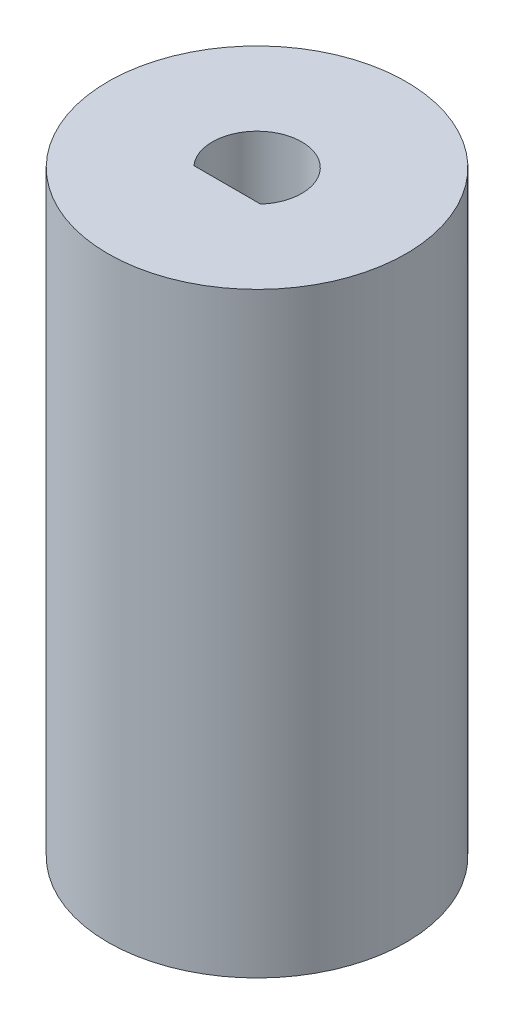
from build123d import *

# Parameters (mm, degrees)
SKETCH1_R           = 10
BOSS_EXTRUDE1_DEPTH = 40
CUT_EXTRUDE1_DEPTH  = 10


with BuildPart() as part:
    # Sketch1 → Boss-Extrude1 (new body)
    with BuildSketch(Plane(origin=(0, 0, 0), x_dir=(1, 0, 0), z_dir=(0, 1, 0))):
        with Locations(Location((0, 0, 0), (0, 0, 270))):
            Circle(SKETCH1_R)
    extrude(amount=BOSS_EXTRUDE1_DEPTH)

    # Sketch2 → Cut-Extrude1 (cut)
    with BuildSketch(Plane(origin=(0, 40, 0), x_dir=(1, 0, 0), z_dir=(0, 1, 0))):
        with BuildLine():
            Line((2.236067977, -2), (-2.236067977, -2))
            ThreePointArc((-2.236067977, -2), (0, 3), (2.236067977, -2))
        make_face()
    extrude(amount=-CUT_EXTRUDE1_DEPTH, mode=Mode.SUBTRACT)


solid = part.part
